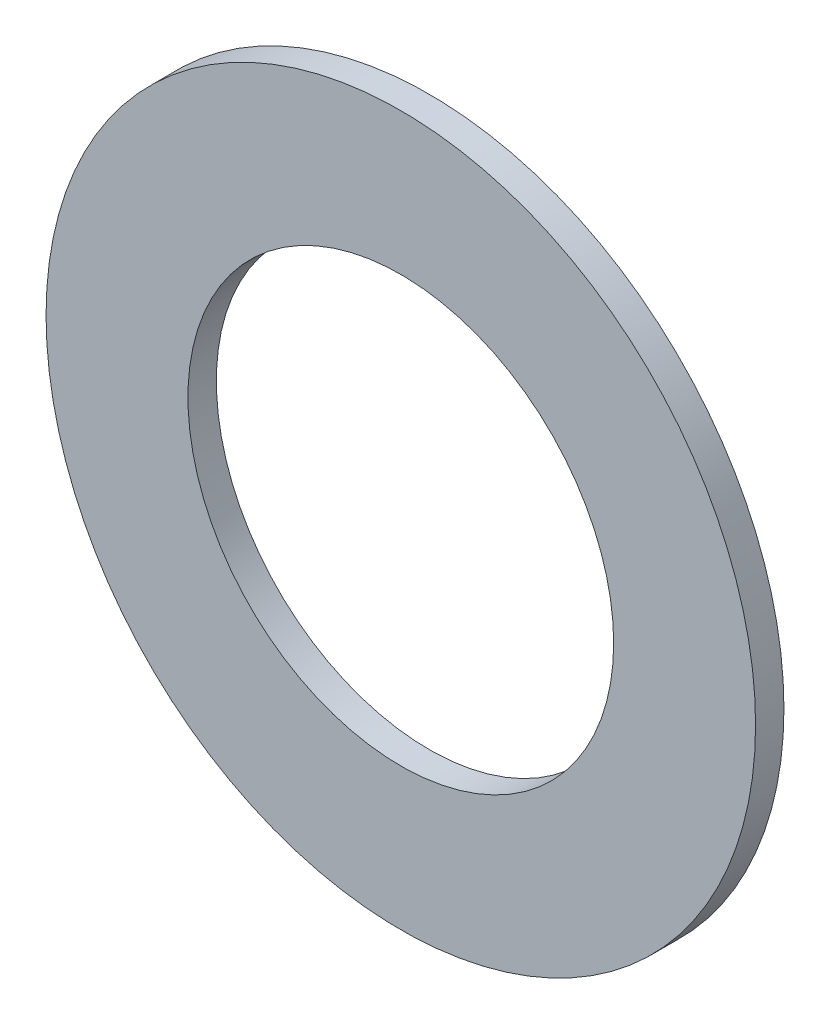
ISO-10303-21;
HEADER;
FILE_DESCRIPTION(('STEP AP214'),'2;1');
FILE_NAME('part.step','',(''),(''),'','','');
FILE_SCHEMA(('AUTOMOTIVE_DESIGN { 1 0 10303 214 1 1 1 1 }'));
ENDSEC;
DATA;
#1=APPLICATION_CONTEXT('core data for automotive mechanical design processes');
#2=APPLICATION_PROTOCOL_DEFINITION('international standard','automotive_design',2000,#1);
#3=PRODUCT_CONTEXT('',#1,'mechanical');
#4=PRODUCT('Part','Part','',(#3));
#5=PRODUCT_RELATED_PRODUCT_CATEGORY('part','',(#4));
#6=PRODUCT_DEFINITION_FORMATION('','',#4);
#7=PRODUCT_DEFINITION_CONTEXT('part definition',#1,'design');
#8=PRODUCT_DEFINITION('design','',#6,#7);
#9=PRODUCT_DEFINITION_SHAPE('','',#8);
#10=(LENGTH_UNIT() NAMED_UNIT(*) SI_UNIT(.MILLI.,.METRE.));
#11=(NAMED_UNIT(*) PLANE_ANGLE_UNIT() SI_UNIT($,.RADIAN.));
#12=(NAMED_UNIT(*) SI_UNIT($,.STERADIAN.) SOLID_ANGLE_UNIT());
#13=UNCERTAINTY_MEASURE_WITH_UNIT(LENGTH_MEASURE(1.E-05),#10,'distance_accuracy_value','');
#14=(GEOMETRIC_REPRESENTATION_CONTEXT(3) GLOBAL_UNCERTAINTY_ASSIGNED_CONTEXT((#13)) GLOBAL_UNIT_ASSIGNED_CONTEXT((#10,
#11,#12)) REPRESENTATION_CONTEXT('',''));
#15=CARTESIAN_POINT('',(0.,0.,0.));
#16=DIRECTION('',(0.,0.,1.));
#17=DIRECTION('',(1.,0.,0.));
#18=AXIS2_PLACEMENT_3D('',#15,#16,#17);
#19=CARTESIAN_POINT('',(0.,0.,2.));
#20=DIRECTION('',(0.,0.,1.));
#21=DIRECTION('',(1.,0.,0.));
#22=AXIS2_PLACEMENT_3D('',#19,#20,#21);
#23=PLANE('',#22);
#24=CARTESIAN_POINT('',(0.,0.,2.));
#25=DIRECTION('',(0.,0.,1.));
#26=DIRECTION('',(1.,0.,0.));
#27=AXIS2_PLACEMENT_3D('',#24,#25,#26);
#28=CIRCLE('',#27,25.);
#29=CARTESIAN_POINT('',(25.,0.,2.));
#30=VERTEX_POINT('',#29);
#31=EDGE_CURVE('E10',#30,#30,#28,.T.);
#32=ORIENTED_EDGE('',*,*,#31,.T.);
#33=EDGE_LOOP('',(#32));
#34=FACE_BOUND('',#33,.T.);
#35=CARTESIAN_POINT('',(0.,0.,2.));
#36=DIRECTION('',(0.,0.,1.));
#37=DIRECTION('',(1.,0.,0.));
#38=AXIS2_PLACEMENT_3D('',#35,#36,#37);
#39=CIRCLE('',#38,15.);
#40=CARTESIAN_POINT('',(15.,0.,2.));
#41=VERTEX_POINT('',#40);
#42=EDGE_CURVE('E45',#41,#41,#39,.T.);
#43=ORIENTED_EDGE('',*,*,#42,.F.);
#44=EDGE_LOOP('',(#43));
#45=FACE_BOUND('',#44,.T.);
#46=ADVANCED_FACE('F34',(#34,#45),#23,.T.);
#47=CARTESIAN_POINT('',(0.,0.,0.));
#48=DIRECTION('',(0.,0.,1.));
#49=DIRECTION('',(1.,0.,0.));
#50=AXIS2_PLACEMENT_3D('',#47,#48,#49);
#51=PLANE('',#50);
#52=CARTESIAN_POINT('',(0.,0.,0.));
#53=DIRECTION('',(0.,0.,1.));
#54=DIRECTION('',(1.,0.,0.));
#55=AXIS2_PLACEMENT_3D('',#52,#53,#54);
#56=CIRCLE('',#55,25.);
#57=CARTESIAN_POINT('',(25.,0.,0.));
#58=VERTEX_POINT('',#57);
#59=EDGE_CURVE('E38',#58,#58,#56,.T.);
#60=ORIENTED_EDGE('',*,*,#59,.F.);
#61=EDGE_LOOP('',(#60));
#62=FACE_BOUND('',#61,.T.);
#63=CARTESIAN_POINT('',(0.,0.,0.));
#64=DIRECTION('',(0.,0.,1.));
#65=DIRECTION('',(1.,0.,0.));
#66=AXIS2_PLACEMENT_3D('',#63,#64,#65);
#67=CIRCLE('',#66,15.);
#68=CARTESIAN_POINT('',(15.,0.,0.));
#69=VERTEX_POINT('',#68);
#70=EDGE_CURVE('E47',#69,#69,#67,.T.);
#71=ORIENTED_EDGE('',*,*,#70,.T.);
#72=EDGE_LOOP('',(#71));
#73=FACE_BOUND('',#72,.T.);
#74=ADVANCED_FACE('F57',(#62,#73),#51,.F.);
#75=CARTESIAN_POINT('',(0.,0.,2.));
#76=DIRECTION('',(0.,0.,-1.));
#77=DIRECTION('',(-1.,0.,0.));
#78=AXIS2_PLACEMENT_3D('',#75,#76,#77);
#79=CYLINDRICAL_SURFACE('',#78,25.);
#80=ORIENTED_EDGE('',*,*,#31,.F.);
#81=EDGE_LOOP('',(#80));
#82=FACE_BOUND('',#81,.T.);
#83=ORIENTED_EDGE('',*,*,#59,.T.);
#84=EDGE_LOOP('',(#83));
#85=FACE_BOUND('',#84,.T.);
#86=ADVANCED_FACE('F36',(#82,#85),#79,.T.);
#87=CARTESIAN_POINT('',(0.,0.,2.));
#88=DIRECTION('',(0.,0.,-1.));
#89=DIRECTION('',(-1.,0.,0.));
#90=AXIS2_PLACEMENT_3D('',#87,#88,#89);
#91=CYLINDRICAL_SURFACE('',#90,15.);
#92=ORIENTED_EDGE('',*,*,#42,.T.);
#93=EDGE_LOOP('',(#92));
#94=FACE_BOUND('',#93,.T.);
#95=ORIENTED_EDGE('',*,*,#70,.F.);
#96=EDGE_LOOP('',(#95));
#97=FACE_BOUND('',#96,.T.);
#98=ADVANCED_FACE('F53',(#94,#97),#91,.F.);
#99=CLOSED_SHELL('',(#46,#74,#86,#98));
#100=MANIFOLD_SOLID_BREP('B2',#99);
#101=ADVANCED_BREP_SHAPE_REPRESENTATION('',(#18,#100),#14);
#102=SHAPE_DEFINITION_REPRESENTATION(#9,#101);
ENDSEC;
END-ISO-10303-21;
